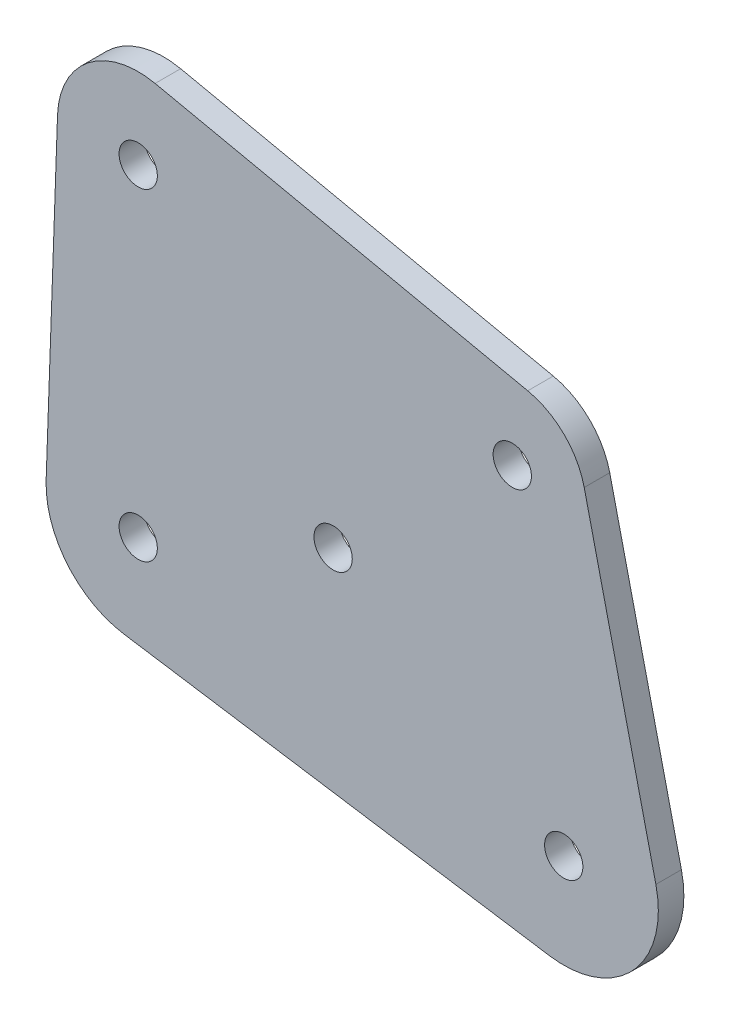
from build123d import *

# Parameters (mm, degrees)
SKETCH1_W          = 1219.2
SKETCH1_H          = 914.4
EXTRUDE1_DEPTH     = 25.4
SKETCH2_R          = 19.05
CUT_EXTRUDE1_DEPTH = 1525.21165197
SKETCH3_OUTSIDE_W  = 1526.042
SKETCH3_OUTSIDE_H  = 1221.242
CUT_EXTRUDE2_DEPTH = 1525.21165197


with BuildPart() as part:
    # Sketch1 → Extrude1 (new body)
    with BuildSketch(Plane.XY):
        with Locations((609.6, 457.2)):
            Rectangle(SKETCH1_W, SKETCH1_H)
    extrude(amount=EXTRUDE1_DEPTH)

    # Sketch2 → Cut-Extrude1 (cut, through all)
    with BuildSketch(Plane.XY.offset(25.4)):
        with Locations((325.835000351, 644.018315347)):
            Circle(SKETCH2_R)
        with Locations((697.941392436, 571.237089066)):
            Circle(SKETCH2_R)
        with Locations((519.73643915, 410.993406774)):
            Circle(SKETCH2_R)
        with Locations((749.130631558, 260.234388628)):
            Circle(SKETCH2_R)
        with Locations((325.835000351, 323.166907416)):
            Circle(SKETCH2_R)
    extrude(amount=-CUT_EXTRUDE1_DEPTH, mode=Mode.SUBTRACT)

    # Sketch3 outside → Cut-Extrude2 (cut, through all)
    with BuildSketch(Plane.XY.offset(25.4)):
        with Locations((609.6, 457.2)):
            Rectangle(SKETCH3_OUTSIDE_W, SKETCH3_OUTSIDE_H)
        with BuildLine():
            Line((245.590918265, 646.860613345), (234.240391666, 326.411248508))
            ThreePointArc((234.240391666, 326.411248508), (255.208009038, 264.755211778), (311.834339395, 232.590533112))
            Line((311.834339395, 232.590533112), (734.752925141, 167.218742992))
            ThreePointArc((734.752925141, 167.218742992), (818.14112672, 196.232979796), (840.801457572, 281.567190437))
            Line((840.801457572, 281.567190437), (769.516030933, 587.893288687))
            ThreePointArc((769.516030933, 587.893288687), (749.4471149, 623.653865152), (713.340186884, 643.092742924))
            Line((713.340186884, 643.092742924), (342.660219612, 722.530119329))
            ThreePointArc((342.660219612, 722.530119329), (276.469459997, 707.344730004), (245.590918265, 646.860613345))
        make_face(mode=Mode.SUBTRACT)
    extrude(amount=-CUT_EXTRUDE2_DEPTH, mode=Mode.SUBTRACT)


solid = part.part
